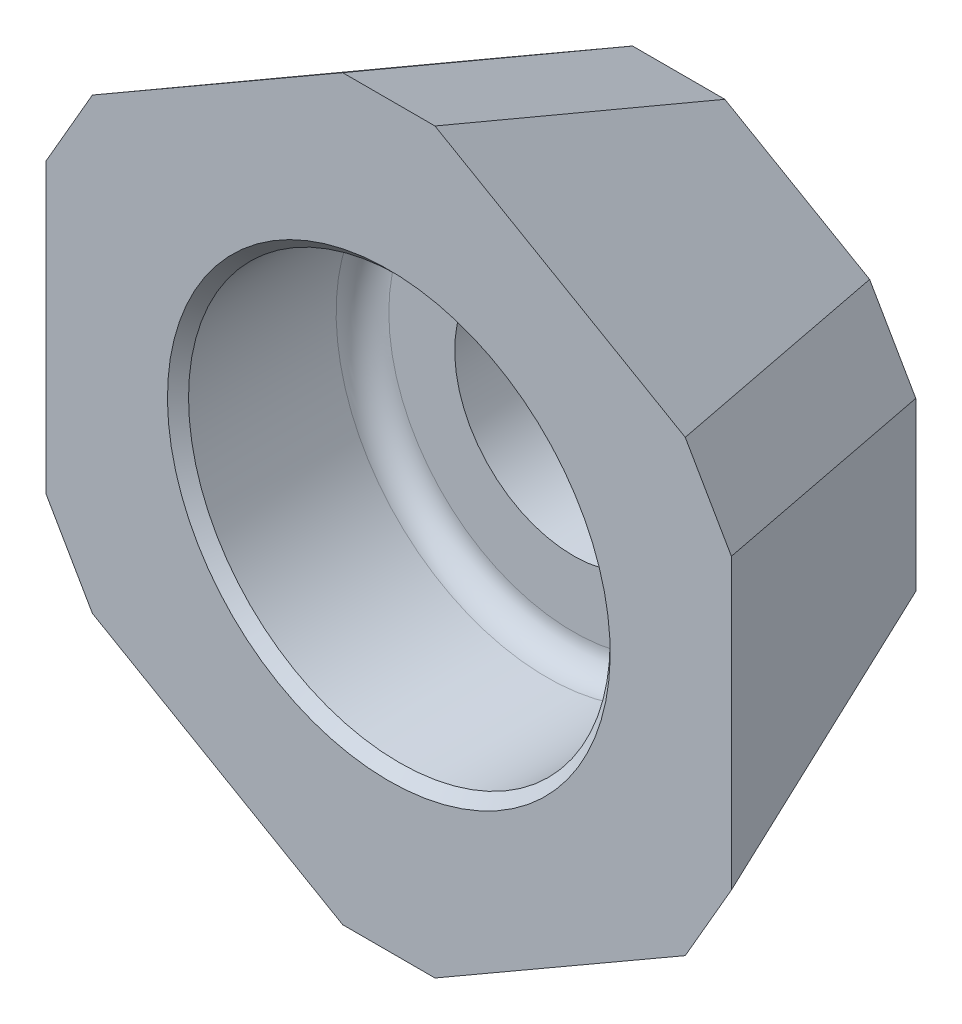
ISO-10303-21;
HEADER;
FILE_DESCRIPTION(('STEP AP214'),'2;1');
FILE_NAME('part.step','',(''),(''),'','','');
FILE_SCHEMA(('AUTOMOTIVE_DESIGN { 1 0 10303 214 1 1 1 1 }'));
ENDSEC;
DATA;
#1=APPLICATION_CONTEXT('core data for automotive mechanical design processes');
#2=APPLICATION_PROTOCOL_DEFINITION('international standard','automotive_design',2000,#1);
#3=PRODUCT_CONTEXT('',#1,'mechanical');
#4=PRODUCT('Part','Part','',(#3));
#5=PRODUCT_RELATED_PRODUCT_CATEGORY('part','',(#4));
#6=PRODUCT_DEFINITION_FORMATION('','',#4);
#7=PRODUCT_DEFINITION_CONTEXT('part definition',#1,'design');
#8=PRODUCT_DEFINITION('design','',#6,#7);
#9=PRODUCT_DEFINITION_SHAPE('','',#8);
#10=(LENGTH_UNIT() NAMED_UNIT(*) SI_UNIT(.MILLI.,.METRE.));
#11=(NAMED_UNIT(*) PLANE_ANGLE_UNIT() SI_UNIT($,.RADIAN.));
#12=(NAMED_UNIT(*) SI_UNIT($,.STERADIAN.) SOLID_ANGLE_UNIT());
#13=UNCERTAINTY_MEASURE_WITH_UNIT(LENGTH_MEASURE(1.E-05),#10,'distance_accuracy_value','');
#14=(GEOMETRIC_REPRESENTATION_CONTEXT(3) GLOBAL_UNCERTAINTY_ASSIGNED_CONTEXT((#13)) GLOBAL_UNIT_ASSIGNED_CONTEXT((#10,
#11,#12)) REPRESENTATION_CONTEXT('',''));
#15=CARTESIAN_POINT('',(0.,0.,0.));
#16=DIRECTION('',(0.,0.,1.));
#17=DIRECTION('',(1.,0.,0.));
#18=AXIS2_PLACEMENT_3D('',#15,#16,#17);
#19=CARTESIAN_POINT('',(8.56217782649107,0.830127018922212,5.5));
#20=DIRECTION('',(-0.798381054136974,0.460945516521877,0.387449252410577));
#21=DIRECTION('',(-0.335540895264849,0.193724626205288,-0.921891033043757));
#22=AXIS2_PLACEMENT_3D('',#19,#20,#21);
#23=PLANE('',#22);
#24=DIRECTION('',(-0.335540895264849,0.193724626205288,-0.921891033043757));
#25=VECTOR('',#24,1.);
#26=CARTESIAN_POINT('',(5.69008017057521,-4.29627631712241,5.68057662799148));
#27=LINE('',#26,#25);
#28=CARTESIAN_POINT('',(5.62435565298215,-4.25833024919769,5.5));
#29=VERTEX_POINT('',#28);
#30=CARTESIAN_POINT('',(3.62251936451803,-3.10256952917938,0.));
#31=VERTEX_POINT('',#30);
#32=EDGE_CURVE('E449',#29,#31,#27,.T.);
#33=ORIENTED_EDGE('',*,*,#32,.T.);
#34=DIRECTION('',(-0.5,-0.86602540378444,0.));
#35=VECTOR('',#34,1.);
#36=CARTESIAN_POINT('',(6.56034153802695,1.98588773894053,0.));
#37=LINE('',#36,#35);
#38=CARTESIAN_POINT('',(4.49816371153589,-1.58590903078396,0.));
#39=VERTEX_POINT('',#38);
#40=EDGE_CURVE('E450',#39,#31,#37,.T.);
#41=ORIENTED_EDGE('',*,*,#40,.F.);
#42=DIRECTION('',(0.335540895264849,-0.193724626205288,0.921891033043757));
#43=VECTOR('',#42,1.);
#44=CARTESIAN_POINT('',(6.07784451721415,-2.49793816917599,4.34013734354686));
#45=LINE('',#44,#43);
#46=CARTESIAN_POINT('',(6.5,-2.74166975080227,5.5));
#47=VERTEX_POINT('',#46);
#48=EDGE_CURVE('E132',#39,#47,#45,.T.);
#49=ORIENTED_EDGE('',*,*,#48,.T.);
#50=DIRECTION('',(-0.5,-0.86602540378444,0.));
#51=VECTOR('',#50,1.);
#52=CARTESIAN_POINT('',(8.56217782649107,0.830127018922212,5.5));
#53=LINE('',#52,#51);
#54=EDGE_CURVE('E447',#47,#29,#53,.T.);
#55=ORIENTED_EDGE('',*,*,#54,.T.);
#56=EDGE_LOOP('',(#33,#41,#49,#55));
#57=FACE_BOUND('',#56,.T.);
#58=ADVANCED_FACE('F14',(#57),#23,.F.);
#59=CARTESIAN_POINT('',(6.5,3.75277674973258,5.5));
#60=DIRECTION('',(0.939692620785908,0.,-0.342020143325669));
#61=DIRECTION('',(0.,-1.,0.));
#62=AXIS2_PLACEMENT_3D('',#59,#60,#61);
#63=PLANE('',#62);
#64=DIRECTION('',(-0.335540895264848,-0.19372462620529,-0.921891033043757));
#65=VECTOR('',#64,1.);
#66=CARTESIAN_POINT('',(6.56572451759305,2.779615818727,5.68057662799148));
#67=LINE('',#66,#65);
#68=CARTESIAN_POINT('',(6.5,2.74166975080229,5.5));
#69=VERTEX_POINT('',#68);
#70=CARTESIAN_POINT('',(4.49816371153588,1.58590903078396,0.));
#71=VERTEX_POINT('',#70);
#72=EDGE_CURVE('E465',#69,#71,#67,.T.);
#73=ORIENTED_EDGE('',*,*,#72,.F.);
#74=CARTESIAN_POINT('',(6.5,-2.74166975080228,5.5));
#75=DIRECTION('',(0.,1.,0.));
#76=VECTOR('',#75,1.);
#77=LINE('',#74,#76);
#78=EDGE_CURVE('E358',#47,#69,#77,.T.);
#79=ORIENTED_EDGE('',*,*,#78,.F.);
#80=ORIENTED_EDGE('',*,*,#48,.F.);
#81=CARTESIAN_POINT('',(4.4981637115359,-1.58590903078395,0.));
#82=DIRECTION('',(0.,1.,0.));
#83=VECTOR('',#82,1.);
#84=LINE('',#81,#83);
#85=EDGE_CURVE('E368',#39,#71,#84,.T.);
#86=ORIENTED_EDGE('',*,*,#85,.T.);
#87=EDGE_LOOP('',(#73,#79,#80,#86));
#88=FACE_BOUND('',#87,.T.);
#89=ADVANCED_FACE('F169',(#88),#63,.T.);
#90=CARTESIAN_POINT('',(3.56217782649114,7.83012701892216,5.5));
#91=DIRECTION('',(-0.798381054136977,-0.46094551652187,0.387449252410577));
#92=DIRECTION('',(0.499999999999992,-0.866025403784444,0.));
#93=AXIS2_PLACEMENT_3D('',#90,#91,#92);
#94=PLANE('',#93);
#95=ORIENTED_EDGE('',*,*,#72,.T.);
#96=DIRECTION('',(0.499999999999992,-0.866025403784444,0.));
#97=VECTOR('',#96,1.);
#98=CARTESIAN_POINT('',(1.56034153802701,6.67436629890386,0.));
#99=LINE('',#98,#97);
#100=CARTESIAN_POINT('',(3.62251936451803,3.10256952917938,0.));
#101=VERTEX_POINT('',#100);
#102=EDGE_CURVE('E37',#101,#71,#99,.T.);
#103=ORIENTED_EDGE('',*,*,#102,.F.);
#104=DIRECTION('',(0.335540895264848,0.193724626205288,0.921891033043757));
#105=VECTOR('',#104,1.);
#106=CARTESIAN_POINT('',(5.20220017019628,4.01459866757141,4.34013734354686));
#107=LINE('',#106,#105);
#108=CARTESIAN_POINT('',(5.62435565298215,4.25833024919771,5.5));
#109=VERTEX_POINT('',#108);
#110=EDGE_CURVE('E442',#101,#109,#107,.T.);
#111=ORIENTED_EDGE('',*,*,#110,.T.);
#112=DIRECTION('',(0.499999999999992,-0.866025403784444,0.));
#113=VECTOR('',#112,1.);
#114=CARTESIAN_POINT('',(3.56217782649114,7.83012701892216,5.5));
#115=LINE('',#114,#113);
#116=EDGE_CURVE('E473',#109,#69,#115,.T.);
#117=ORIENTED_EDGE('',*,*,#116,.T.);
#118=EDGE_LOOP('',(#95,#103,#111,#117));
#119=FACE_BOUND('',#118,.T.);
#120=ADVANCED_FACE('F276',(#119),#94,.F.);
#121=CARTESIAN_POINT('',(0.,7.50555349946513,5.5));
#122=DIRECTION('',(0.469846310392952,0.813797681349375,-0.34202014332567));
#123=DIRECTION('',(0.86602540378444,-0.5,0.));
#124=AXIS2_PLACEMENT_3D('',#121,#122,#123);
#125=PLANE('',#124);
#126=DIRECTION('',(0.,-0.387449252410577,-0.921891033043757));
#127=VECTOR('',#126,1.);
#128=CARTESIAN_POINT('',(0.87564434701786,7.07589213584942,5.68057662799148));
#129=LINE('',#128,#127);
#130=CARTESIAN_POINT('',(0.875644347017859,7.,5.5));
#131=VERTEX_POINT('',#130);
#132=CARTESIAN_POINT('',(0.875644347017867,4.68847855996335,0.));
#133=VERTEX_POINT('',#132);
#134=EDGE_CURVE('E469',#131,#133,#129,.T.);
#135=ORIENTED_EDGE('',*,*,#134,.F.);
#136=CARTESIAN_POINT('',(5.62435565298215,4.25833024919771,5.5));
#137=DIRECTION('',(-0.866025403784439,0.499999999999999,0.));
#138=VECTOR('',#137,1.);
#139=LINE('',#136,#138);
#140=EDGE_CURVE('E529',#109,#131,#139,.T.);
#141=ORIENTED_EDGE('',*,*,#140,.F.);
#142=ORIENTED_EDGE('',*,*,#110,.F.);
#143=CARTESIAN_POINT('',(3.62251936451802,3.10256952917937,0.));
#144=DIRECTION('',(-0.866025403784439,0.499999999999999,0.));
#145=VECTOR('',#144,1.);
#146=LINE('',#143,#145);
#147=EDGE_CURVE('E441',#101,#133,#146,.T.);
#148=ORIENTED_EDGE('',*,*,#147,.T.);
#149=EDGE_LOOP('',(#135,#141,#142,#148));
#150=FACE_BOUND('',#149,.T.);
#151=ADVANCED_FACE('F283',(#150),#125,.T.);
#152=CARTESIAN_POINT('',(-5.,7.,5.5));
#153=DIRECTION('',(0.,-0.921891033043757,0.387449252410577));
#154=DIRECTION('',(1.,0.,0.));
#155=AXIS2_PLACEMENT_3D('',#152,#153,#154);
#156=PLANE('',#155);
#157=ORIENTED_EDGE('',*,*,#134,.T.);
#158=DIRECTION('',(1.,0.,0.));
#159=VECTOR('',#158,1.);
#160=CARTESIAN_POINT('',(-5.,4.68847855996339,0.));
#161=LINE('',#160,#159);
#162=CARTESIAN_POINT('',(-0.875644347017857,4.68847855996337,0.));
#163=VERTEX_POINT('',#162);
#164=EDGE_CURVE('E489',#163,#133,#161,.T.);
#165=ORIENTED_EDGE('',*,*,#164,.F.);
#166=DIRECTION('',(0.,0.387449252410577,0.921891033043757));
#167=VECTOR('',#166,1.);
#168=CARTESIAN_POINT('',(-0.875644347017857,6.51253683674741,4.34013734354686));
#169=LINE('',#168,#167);
#170=CARTESIAN_POINT('',(-0.875644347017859,7.,5.5));
#171=VERTEX_POINT('',#170);
#172=EDGE_CURVE('E420',#163,#171,#169,.T.);
#173=ORIENTED_EDGE('',*,*,#172,.T.);
#174=DIRECTION('',(1.,0.,0.));
#175=VECTOR('',#174,1.);
#176=CARTESIAN_POINT('',(-5.,7.,5.5));
#177=LINE('',#176,#175);
#178=EDGE_CURVE('E477',#171,#131,#177,.T.);
#179=ORIENTED_EDGE('',*,*,#178,.T.);
#180=EDGE_LOOP('',(#157,#165,#173,#179));
#181=FACE_BOUND('',#180,.T.);
#182=ADVANCED_FACE('F285',(#181),#156,.F.);
#183=CARTESIAN_POINT('',(-6.5,3.75277674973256,5.5));
#184=DIRECTION('',(-0.469846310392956,0.813797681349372,-0.34202014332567));
#185=DIRECTION('',(0.866025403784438,0.5,0.));
#186=AXIS2_PLACEMENT_3D('',#183,#184,#185);
#187=PLANE('',#186);
#188=ORIENTED_EDGE('',*,*,#172,.F.);
#189=CARTESIAN_POINT('',(-0.875644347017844,4.68847855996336,0.));
#190=DIRECTION('',(-0.866025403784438,-0.500000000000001,0.));
#191=VECTOR('',#190,1.);
#192=LINE('',#189,#191);
#193=CARTESIAN_POINT('',(-3.62251936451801,3.10256952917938,0.));
#194=VERTEX_POINT('',#193);
#195=EDGE_CURVE('E414',#163,#194,#192,.T.);
#196=ORIENTED_EDGE('',*,*,#195,.T.);
#197=DIRECTION('',(0.335540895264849,-0.193724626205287,-0.921891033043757));
#198=VECTOR('',#197,1.);
#199=CARTESIAN_POINT('',(-5.6900801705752,4.29627631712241,5.68057662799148));
#200=LINE('',#199,#198);
#201=CARTESIAN_POINT('',(-5.62435565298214,4.2583302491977,5.5));
#202=VERTEX_POINT('',#201);
#203=EDGE_CURVE('E113',#202,#194,#200,.T.);
#204=ORIENTED_EDGE('',*,*,#203,.F.);
#205=CARTESIAN_POINT('',(-0.875644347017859,7.00000000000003,5.5));
#206=DIRECTION('',(-0.86602540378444,-0.499999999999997,0.));
#207=VECTOR('',#206,1.);
#208=LINE('',#205,#207);
#209=EDGE_CURVE('E527',#171,#202,#208,.T.);
#210=ORIENTED_EDGE('',*,*,#209,.F.);
#211=EDGE_LOOP('',(#188,#196,#204,#210));
#212=FACE_BOUND('',#211,.T.);
#213=ADVANCED_FACE('F292',(#212),#187,.T.);
#214=CARTESIAN_POINT('',(-8.56217782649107,-0.830127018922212,5.5));
#215=DIRECTION('',(0.798381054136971,-0.460945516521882,0.387449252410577));
#216=DIRECTION('',(-0.335540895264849,0.193724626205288,0.921891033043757));
#217=AXIS2_PLACEMENT_3D('',#214,#215,#216);
#218=PLANE('',#217);
#219=ORIENTED_EDGE('',*,*,#203,.T.);
#220=DIRECTION('',(0.5,0.866025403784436,0.));
#221=VECTOR('',#220,1.);
#222=CARTESIAN_POINT('',(-6.56034153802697,-1.98588773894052,0.));
#223=LINE('',#222,#221);
#224=CARTESIAN_POINT('',(-4.49816371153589,1.58590903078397,0.));
#225=VERTEX_POINT('',#224);
#226=EDGE_CURVE('E126',#225,#194,#223,.T.);
#227=ORIENTED_EDGE('',*,*,#226,.F.);
#228=DIRECTION('',(-0.335540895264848,0.193724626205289,0.921891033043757));
#229=VECTOR('',#228,1.);
#230=CARTESIAN_POINT('',(-6.07784451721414,2.49793816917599,4.34013734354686));
#231=LINE('',#230,#229);
#232=CARTESIAN_POINT('',(-6.5,2.74166975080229,5.5));
#233=VERTEX_POINT('',#232);
#234=EDGE_CURVE('E521',#225,#233,#231,.T.);
#235=ORIENTED_EDGE('',*,*,#234,.T.);
#236=DIRECTION('',(0.5,0.866025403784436,0.));
#237=VECTOR('',#236,1.);
#238=CARTESIAN_POINT('',(-8.56217782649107,-0.830127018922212,5.5));
#239=LINE('',#238,#237);
#240=EDGE_CURVE('E492',#233,#202,#239,.T.);
#241=ORIENTED_EDGE('',*,*,#240,.T.);
#242=EDGE_LOOP('',(#219,#227,#235,#241));
#243=FACE_BOUND('',#242,.T.);
#244=ADVANCED_FACE('F297',(#243),#218,.F.);
#245=CARTESIAN_POINT('',(-6.5,-3.75277674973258,5.5));
#246=DIRECTION('',(-0.939692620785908,0.,-0.342020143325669));
#247=DIRECTION('',(0.,1.,0.));
#248=AXIS2_PLACEMENT_3D('',#245,#246,#247);
#249=PLANE('',#248);
#250=ORIENTED_EDGE('',*,*,#234,.F.);
#251=CARTESIAN_POINT('',(-4.4981637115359,1.58590903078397,0.));
#252=DIRECTION('',(0.,-1.,0.));
#253=VECTOR('',#252,1.);
#254=LINE('',#251,#253);
#255=CARTESIAN_POINT('',(-4.49816371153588,-1.58590903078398,0.));
#256=VERTEX_POINT('',#255);
#257=EDGE_CURVE('E452',#225,#256,#254,.T.);
#258=ORIENTED_EDGE('',*,*,#257,.T.);
#259=DIRECTION('',(0.335540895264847,0.193724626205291,-0.921891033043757));
#260=VECTOR('',#259,1.);
#261=CARTESIAN_POINT('',(-6.56572451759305,-2.77961581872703,5.68057662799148));
#262=LINE('',#261,#260);
#263=CARTESIAN_POINT('',(-6.5,-2.74166975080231,5.5));
#264=VERTEX_POINT('',#263);
#265=EDGE_CURVE('E519',#264,#256,#262,.T.);
#266=ORIENTED_EDGE('',*,*,#265,.F.);
#267=CARTESIAN_POINT('',(-6.5,2.74166975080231,5.5));
#268=DIRECTION('',(0.,-1.,0.));
#269=VECTOR('',#268,1.);
#270=LINE('',#267,#269);
#271=EDGE_CURVE('E124',#233,#264,#270,.T.);
#272=ORIENTED_EDGE('',*,*,#271,.F.);
#273=EDGE_LOOP('',(#250,#258,#266,#272));
#274=FACE_BOUND('',#273,.T.);
#275=ADVANCED_FACE('F262',(#274),#249,.T.);
#276=CARTESIAN_POINT('',(-3.56217782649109,-7.83012701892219,5.5));
#277=DIRECTION('',(0.798381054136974,0.460945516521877,0.387449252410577));
#278=DIRECTION('',(-0.5,0.866025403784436,0.));
#279=AXIS2_PLACEMENT_3D('',#276,#277,#278);
#280=PLANE('',#279);
#281=DIRECTION('',(-0.335540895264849,-0.193724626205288,0.921891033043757));
#282=VECTOR('',#281,1.);
#283=CARTESIAN_POINT('',(-5.20220017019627,-4.01459866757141,4.34013734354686));
#284=LINE('',#283,#282);
#285=CARTESIAN_POINT('',(-3.62251936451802,-3.10256952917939,0.));
#286=VERTEX_POINT('',#285);
#287=CARTESIAN_POINT('',(-5.62435565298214,-4.25833024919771,5.5));
#288=VERTEX_POINT('',#287);
#289=EDGE_CURVE('E102',#286,#288,#284,.T.);
#290=ORIENTED_EDGE('',*,*,#289,.T.);
#291=DIRECTION('',(-0.5,0.866025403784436,0.));
#292=VECTOR('',#291,1.);
#293=CARTESIAN_POINT('',(-3.56217782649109,-7.83012701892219,5.5));
#294=LINE('',#293,#292);
#295=EDGE_CURVE('E105',#288,#264,#294,.T.);
#296=ORIENTED_EDGE('',*,*,#295,.T.);
#297=ORIENTED_EDGE('',*,*,#265,.T.);
#298=DIRECTION('',(-0.5,0.866025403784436,0.));
#299=VECTOR('',#298,1.);
#300=CARTESIAN_POINT('',(-1.56034153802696,-6.67436629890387,0.));
#301=LINE('',#300,#299);
#302=EDGE_CURVE('E108',#286,#256,#301,.T.);
#303=ORIENTED_EDGE('',*,*,#302,.F.);
#304=EDGE_LOOP('',(#290,#296,#297,#303));
#305=FACE_BOUND('',#304,.T.);
#306=ADVANCED_FACE('F104',(#305),#280,.F.);
#307=CARTESIAN_POINT('',(0.,-7.50555349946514,5.5));
#308=DIRECTION('',(-0.469846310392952,-0.813797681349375,-0.342020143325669));
#309=DIRECTION('',(-0.86602540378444,0.5,0.));
#310=AXIS2_PLACEMENT_3D('',#307,#308,#309);
#311=PLANE('',#310);
#312=DIRECTION('',(0.,0.387449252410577,-0.921891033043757));
#313=VECTOR('',#312,1.);
#314=CARTESIAN_POINT('',(-0.875644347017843,-7.07589213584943,5.68057662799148));
#315=LINE('',#314,#313);
#316=CARTESIAN_POINT('',(-0.875644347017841,-7.,5.5));
#317=VERTEX_POINT('',#316);
#318=CARTESIAN_POINT('',(-0.875644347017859,-4.68847855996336,0.));
#319=VERTEX_POINT('',#318);
#320=EDGE_CURVE('E131',#317,#319,#315,.T.);
#321=ORIENTED_EDGE('',*,*,#320,.F.);
#322=CARTESIAN_POINT('',(-5.62435565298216,-4.25833024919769,5.5));
#323=DIRECTION('',(0.866025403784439,-0.5,0.));
#324=VECTOR('',#323,1.);
#325=LINE('',#322,#324);
#326=EDGE_CURVE('E120',#288,#317,#325,.T.);
#327=ORIENTED_EDGE('',*,*,#326,.F.);
#328=ORIENTED_EDGE('',*,*,#289,.F.);
#329=CARTESIAN_POINT('',(-3.62251936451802,-3.10256952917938,0.));
#330=DIRECTION('',(0.866025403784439,-0.499999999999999,0.));
#331=VECTOR('',#330,1.);
#332=LINE('',#329,#331);
#333=EDGE_CURVE('E220',#286,#319,#332,.T.);
#334=ORIENTED_EDGE('',*,*,#333,.T.);
#335=EDGE_LOOP('',(#321,#327,#328,#334));
#336=FACE_BOUND('',#335,.T.);
#337=ADVANCED_FACE('F130',(#336),#311,.T.);
#338=CARTESIAN_POINT('',(5.,-7.,5.5));
#339=DIRECTION('',(0.,0.921891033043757,0.387449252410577));
#340=DIRECTION('',(-1.,0.,0.));
#341=AXIS2_PLACEMENT_3D('',#338,#339,#340);
#342=PLANE('',#341);
#343=ORIENTED_EDGE('',*,*,#320,.T.);
#344=DIRECTION('',(-1.,0.,0.));
#345=VECTOR('',#344,1.);
#346=CARTESIAN_POINT('',(5.,-4.68847855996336,0.));
#347=LINE('',#346,#345);
#348=CARTESIAN_POINT('',(0.875644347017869,-4.68847855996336,0.));
#349=VERTEX_POINT('',#348);
#350=EDGE_CURVE('E29',#349,#319,#347,.T.);
#351=ORIENTED_EDGE('',*,*,#350,.F.);
#352=DIRECTION('',(0.,-0.387449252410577,0.921891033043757));
#353=VECTOR('',#352,1.);
#354=CARTESIAN_POINT('',(0.875644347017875,-6.51253683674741,4.34013734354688));
#355=LINE('',#354,#353);
#356=CARTESIAN_POINT('',(0.875644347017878,-7.,5.5));
#357=VERTEX_POINT('',#356);
#358=EDGE_CURVE('E200',#349,#357,#355,.T.);
#359=ORIENTED_EDGE('',*,*,#358,.T.);
#360=DIRECTION('',(-1.,0.,0.));
#361=VECTOR('',#360,1.);
#362=CARTESIAN_POINT('',(5.,-7.,5.5));
#363=LINE('',#362,#361);
#364=EDGE_CURVE('E448',#357,#317,#363,.T.);
#365=ORIENTED_EDGE('',*,*,#364,.T.);
#366=EDGE_LOOP('',(#343,#351,#359,#365));
#367=FACE_BOUND('',#366,.T.);
#368=ADVANCED_FACE('F158',(#367),#342,.F.);
#369=CARTESIAN_POINT('',(6.5,-3.75277674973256,5.5));
#370=DIRECTION('',(0.469846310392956,-0.813797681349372,-0.34202014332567));
#371=DIRECTION('',(-0.866025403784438,-0.5,0.));
#372=AXIS2_PLACEMENT_3D('',#369,#370,#371);
#373=PLANE('',#372);
#374=ORIENTED_EDGE('',*,*,#358,.F.);
#375=CARTESIAN_POINT('',(0.875644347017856,-4.68847855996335,0.));
#376=DIRECTION('',(0.866025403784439,0.5,0.));
#377=VECTOR('',#376,1.);
#378=LINE('',#375,#377);
#379=EDGE_CURVE('E192',#349,#31,#378,.T.);
#380=ORIENTED_EDGE('',*,*,#379,.T.);
#381=ORIENTED_EDGE('',*,*,#32,.F.);
#382=CARTESIAN_POINT('',(0.875644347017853,-7.,5.5));
#383=DIRECTION('',(0.866025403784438,0.500000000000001,0.));
#384=VECTOR('',#383,1.);
#385=LINE('',#382,#384);
#386=EDGE_CURVE('E445',#357,#29,#385,.T.);
#387=ORIENTED_EDGE('',*,*,#386,.F.);
#388=EDGE_LOOP('',(#374,#380,#381,#387));
#389=FACE_BOUND('',#388,.T.);
#390=ADVANCED_FACE('F160',(#389),#373,.T.);
#391=CARTESIAN_POINT('',(-4.49816371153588,-2.59701602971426,0.));
#392=DIRECTION('',(0.,0.,1.));
#393=DIRECTION('',(-0.5,-0.86602540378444,0.));
#394=AXIS2_PLACEMENT_3D('',#391,#392,#393);
#395=PLANE('',#394);
#396=CARTESIAN_POINT('',(0.,0.,0.));
#397=DIRECTION('',(0.,0.,1.));
#398=DIRECTION('',(-0.5,-0.86602540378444,0.));
#399=AXIS2_PLACEMENT_3D('',#396,#397,#398);
#400=CIRCLE('',#399,2.45);
#401=CARTESIAN_POINT('',(-1.225,-2.12176223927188,0.));
#402=VERTEX_POINT('',#401);
#403=EDGE_CURVE('E9',#402,#402,#400,.T.);
#404=ORIENTED_EDGE('',*,*,#403,.T.);
#405=EDGE_LOOP('',(#404));
#406=FACE_BOUND('',#405,.T.);
#407=ORIENTED_EDGE('',*,*,#379,.F.);
#408=ORIENTED_EDGE('',*,*,#350,.T.);
#409=ORIENTED_EDGE('',*,*,#333,.F.);
#410=ORIENTED_EDGE('',*,*,#302,.T.);
#411=ORIENTED_EDGE('',*,*,#257,.F.);
#412=ORIENTED_EDGE('',*,*,#226,.T.);
#413=ORIENTED_EDGE('',*,*,#195,.F.);
#414=ORIENTED_EDGE('',*,*,#164,.T.);
#415=ORIENTED_EDGE('',*,*,#147,.F.);
#416=ORIENTED_EDGE('',*,*,#102,.T.);
#417=ORIENTED_EDGE('',*,*,#85,.F.);
#418=ORIENTED_EDGE('',*,*,#40,.T.);
#419=EDGE_LOOP('',(#407,#408,#409,#410,#411,#412,#413,#414,#415,#416,#417,#418));
#420=FACE_BOUND('',#419,.T.);
#421=ADVANCED_FACE('F161',(#406,#420),#395,.F.);
#422=CARTESIAN_POINT('',(0.,0.,0.2));
#423=DIRECTION('',(0.,0.,-1.));
#424=DIRECTION('',(0.5,0.86602540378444,0.));
#425=AXIS2_PLACEMENT_3D('',#422,#423,#424);
#426=CONICAL_SURFACE('',#425,2.25,0.785398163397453);
#427=ORIENTED_EDGE('',*,*,#403,.F.);
#428=EDGE_LOOP('',(#427));
#429=FACE_BOUND('',#428,.T.);
#430=CARTESIAN_POINT('',(0.,0.,0.2));
#431=DIRECTION('',(0.,0.,1.));
#432=DIRECTION('',(-0.5,-0.86602540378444,0.));
#433=AXIS2_PLACEMENT_3D('',#430,#431,#432);
#434=CIRCLE('',#433,2.25);
#435=CARTESIAN_POINT('',(-1.125,-1.94855715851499,0.2));
#436=VERTEX_POINT('',#435);
#437=EDGE_CURVE('E22',#436,#436,#434,.F.);
#438=ORIENTED_EDGE('',*,*,#437,.F.);
#439=EDGE_LOOP('',(#438));
#440=FACE_BOUND('',#439,.T.);
#441=ADVANCED_FACE('F16',(#429,#440),#426,.F.);
#442=CARTESIAN_POINT('',(0.,0.,5.5));
#443=DIRECTION('',(0.,0.,-1.));
#444=DIRECTION('',(0.5,0.86602540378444,0.));
#445=AXIS2_PLACEMENT_3D('',#442,#443,#444);
#446=CYLINDRICAL_SURFACE('',#445,2.25);
#447=ORIENTED_EDGE('',*,*,#437,.T.);
#448=EDGE_LOOP('',(#447));
#449=FACE_BOUND('',#448,.T.);
#450=CARTESIAN_POINT('',(0.,0.,2.));
#451=DIRECTION('',(0.,0.,-1.));
#452=DIRECTION('',(0.5,0.86602540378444,0.));
#453=AXIS2_PLACEMENT_3D('',#450,#451,#452);
#454=CIRCLE('',#453,2.25);
#455=CARTESIAN_POINT('',(1.125,1.94855715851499,2.));
#456=VERTEX_POINT('',#455);
#457=EDGE_CURVE('E476',#456,#456,#454,.F.);
#458=ORIENTED_EDGE('',*,*,#457,.T.);
#459=EDGE_LOOP('',(#458));
#460=FACE_BOUND('',#459,.T.);
#461=ADVANCED_FACE('F159',(#449,#460),#446,.F.);
#462=CARTESIAN_POINT('',(6.5,-3.75277674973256,5.5));
#463=DIRECTION('',(0.,0.,1.));
#464=DIRECTION('',(-0.5,-0.86602540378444,0.));
#465=AXIS2_PLACEMENT_3D('',#462,#463,#464);
#466=PLANE('',#465);
#467=CARTESIAN_POINT('',(0.,0.,5.5));
#468=DIRECTION('',(0.,0.,1.));
#469=DIRECTION('',(-0.5,-0.86602540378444,0.));
#470=AXIS2_PLACEMENT_3D('',#467,#468,#469);
#471=CIRCLE('',#470,4.2);
#472=CARTESIAN_POINT('',(-2.1,-3.63730669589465,5.5));
#473=VERTEX_POINT('',#472);
#474=EDGE_CURVE('E224',#473,#473,#471,.F.);
#475=ORIENTED_EDGE('',*,*,#474,.T.);
#476=EDGE_LOOP('',(#475));
#477=FACE_BOUND('',#476,.T.);
#478=ORIENTED_EDGE('',*,*,#364,.F.);
#479=ORIENTED_EDGE('',*,*,#386,.T.);
#480=ORIENTED_EDGE('',*,*,#54,.F.);
#481=ORIENTED_EDGE('',*,*,#78,.T.);
#482=ORIENTED_EDGE('',*,*,#116,.F.);
#483=ORIENTED_EDGE('',*,*,#140,.T.);
#484=ORIENTED_EDGE('',*,*,#178,.F.);
#485=ORIENTED_EDGE('',*,*,#209,.T.);
#486=ORIENTED_EDGE('',*,*,#240,.F.);
#487=ORIENTED_EDGE('',*,*,#271,.T.);
#488=ORIENTED_EDGE('',*,*,#295,.F.);
#489=ORIENTED_EDGE('',*,*,#326,.T.);
#490=EDGE_LOOP('',(#478,#479,#480,#481,#482,#483,#484,#485,#486,#487,#488,#489));
#491=FACE_BOUND('',#490,.T.);
#492=ADVANCED_FACE('F119',(#477,#491),#466,.T.);
#493=CARTESIAN_POINT('',(0.,0.,5.5));
#494=DIRECTION('',(0.,0.,1.));
#495=DIRECTION('',(-0.5,-0.86602540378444,0.));
#496=AXIS2_PLACEMENT_3D('',#493,#494,#495);
#497=CONICAL_SURFACE('',#496,4.2,0.785398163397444);
#498=CARTESIAN_POINT('',(0.,0.,5.3));
#499=DIRECTION('',(0.,0.,1.));
#500=DIRECTION('',(-0.5,-0.86602540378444,0.));
#501=AXIS2_PLACEMENT_3D('',#498,#499,#500);
#502=CIRCLE('',#501,4.);
#503=CARTESIAN_POINT('',(-2.,-3.46410161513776,5.3));
#504=VERTEX_POINT('',#503);
#505=EDGE_CURVE('E227',#504,#504,#502,.T.);
#506=ORIENTED_EDGE('',*,*,#505,.F.);
#507=EDGE_LOOP('',(#506));
#508=FACE_BOUND('',#507,.T.);
#509=ORIENTED_EDGE('',*,*,#474,.F.);
#510=EDGE_LOOP('',(#509));
#511=FACE_BOUND('',#510,.T.);
#512=ADVANCED_FACE('F237',(#508,#511),#497,.F.);
#513=CARTESIAN_POINT('',(0.,0.,5.5));
#514=DIRECTION('',(0.,0.,-1.));
#515=DIRECTION('',(0.5,0.86602540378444,0.));
#516=AXIS2_PLACEMENT_3D('',#513,#514,#515);
#517=CYLINDRICAL_SURFACE('',#516,4.);
#518=ORIENTED_EDGE('',*,*,#505,.T.);
#519=EDGE_LOOP('',(#518));
#520=FACE_BOUND('',#519,.T.);
#521=CARTESIAN_POINT('',(0.,0.,2.5));
#522=DIRECTION('',(0.,0.,-1.));
#523=DIRECTION('',(0.5,0.86602540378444,0.));
#524=AXIS2_PLACEMENT_3D('',#521,#522,#523);
#525=CIRCLE('',#524,4.);
#526=CARTESIAN_POINT('',(2.,3.46410161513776,2.5));
#527=VERTEX_POINT('',#526);
#528=EDGE_CURVE('E221',#527,#527,#525,.T.);
#529=ORIENTED_EDGE('',*,*,#528,.T.);
#530=EDGE_LOOP('',(#529));
#531=FACE_BOUND('',#530,.T.);
#532=ADVANCED_FACE('F245',(#520,#531),#517,.F.);
#533=CARTESIAN_POINT('',(0.,0.,2.5));
#534=DIRECTION('',(0.,0.,-1.));
#535=DIRECTION('',(0.5,0.86602540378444,0.));
#536=AXIS2_PLACEMENT_3D('',#533,#534,#535);
#537=TOROIDAL_SURFACE('',#536,3.5,0.5);
#538=CARTESIAN_POINT('',(0.,0.,2.));
#539=DIRECTION('',(0.,0.,1.));
#540=DIRECTION('',(-0.5,-0.86602540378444,0.));
#541=AXIS2_PLACEMENT_3D('',#538,#539,#540);
#542=CIRCLE('',#541,3.5);
#543=CARTESIAN_POINT('',(-1.75,-3.03108891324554,2.));
#544=VERTEX_POINT('',#543);
#545=EDGE_CURVE('E538',#544,#544,#542,.T.);
#546=ORIENTED_EDGE('',*,*,#545,.F.);
#547=EDGE_LOOP('',(#546));
#548=FACE_BOUND('',#547,.T.);
#549=ORIENTED_EDGE('',*,*,#528,.F.);
#550=EDGE_LOOP('',(#549));
#551=FACE_BOUND('',#550,.T.);
#552=ADVANCED_FACE('F249',(#548,#551),#537,.F.);
#553=CARTESIAN_POINT('',(-3.03108891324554,1.75,2.));
#554=DIRECTION('',(0.,0.,-1.));
#555=DIRECTION('',(0.5,0.86602540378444,0.));
#556=AXIS2_PLACEMENT_3D('',#553,#554,#555);
#557=PLANE('',#556);
#558=ORIENTED_EDGE('',*,*,#545,.T.);
#559=EDGE_LOOP('',(#558));
#560=FACE_BOUND('',#559,.T.);
#561=ORIENTED_EDGE('',*,*,#457,.F.);
#562=EDGE_LOOP('',(#561));
#563=FACE_BOUND('',#562,.T.);
#564=ADVANCED_FACE('F236',(#560,#563),#557,.F.);
#565=CLOSED_SHELL('',(#58,#89,#120,#151,#182,#213,#244,#275,#306,#337,#368,#390,#421,#441,#461,
#492,#512,#532,#552,#564));
#566=MANIFOLD_SOLID_BREP('B1',#565);
#567=ADVANCED_BREP_SHAPE_REPRESENTATION('',(#18,#566),#14);
#568=SHAPE_DEFINITION_REPRESENTATION(#9,#567);
ENDSEC;
END-ISO-10303-21;
